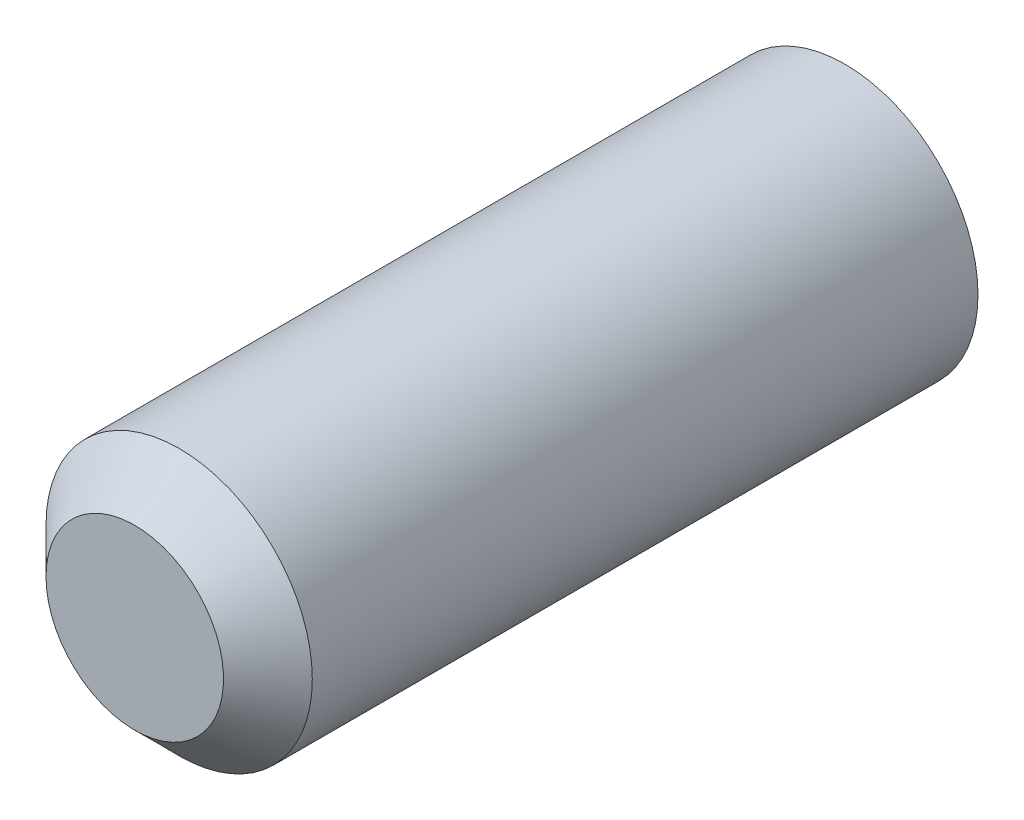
from build123d import *

# Parameters (mm, degrees)
SKETCH1_R      = 4.7625
EXTRUDE1_DEPTH = 25.4
CHAMFER1_SIZE  = 1.5875


with BuildPart() as part:
    # Sketch1 → Extrude1 (new body)
    with BuildSketch(Plane.XY):
        Circle(SKETCH1_R)
    extrude(amount=EXTRUDE1_DEPTH)

    # Chamfer1
    chamfer1_edges = [part.edges().sort_by_distance(p)[0] for p in [
        (-4.7625, 0, 25.4),
    ]]
    chamfer(chamfer1_edges, length=CHAMFER1_SIZE)


solid = part.part
